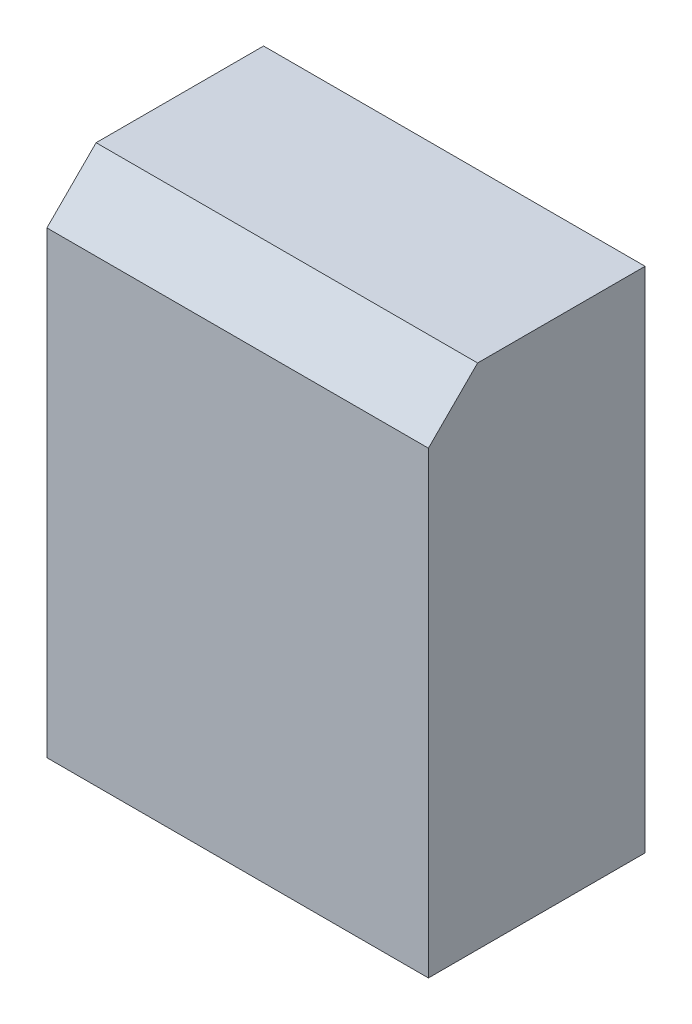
from build123d import *

# Parameters (mm, degrees)
SKETCH1_W           = 77.56152954
SKETCH1_H           = 44.050624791
BOSS_EXTRUDE1_DEPTH = 103.285343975
CHAMFER1_SIZE       = 10


with BuildPart() as part:
    # Sketch1 → Boss-Extrude1 (new body)
    with BuildSketch(Plane(origin=(0, 0, 0), x_dir=(1, 0, 0), z_dir=(0, 1, 0))):
        with Locations((6.080607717, -5.404984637)):
            Rectangle(SKETCH1_W, SKETCH1_H)
    extrude(amount=BOSS_EXTRUDE1_DEPTH)

    # Chamfer1
    chamfer1_edges = [part.edges().sort_by_distance(p)[0] for p in [
        (6.080607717, 103.285343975, 27.430297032),
    ]]
    chamfer(chamfer1_edges, length=CHAMFER1_SIZE)


solid = part.part
